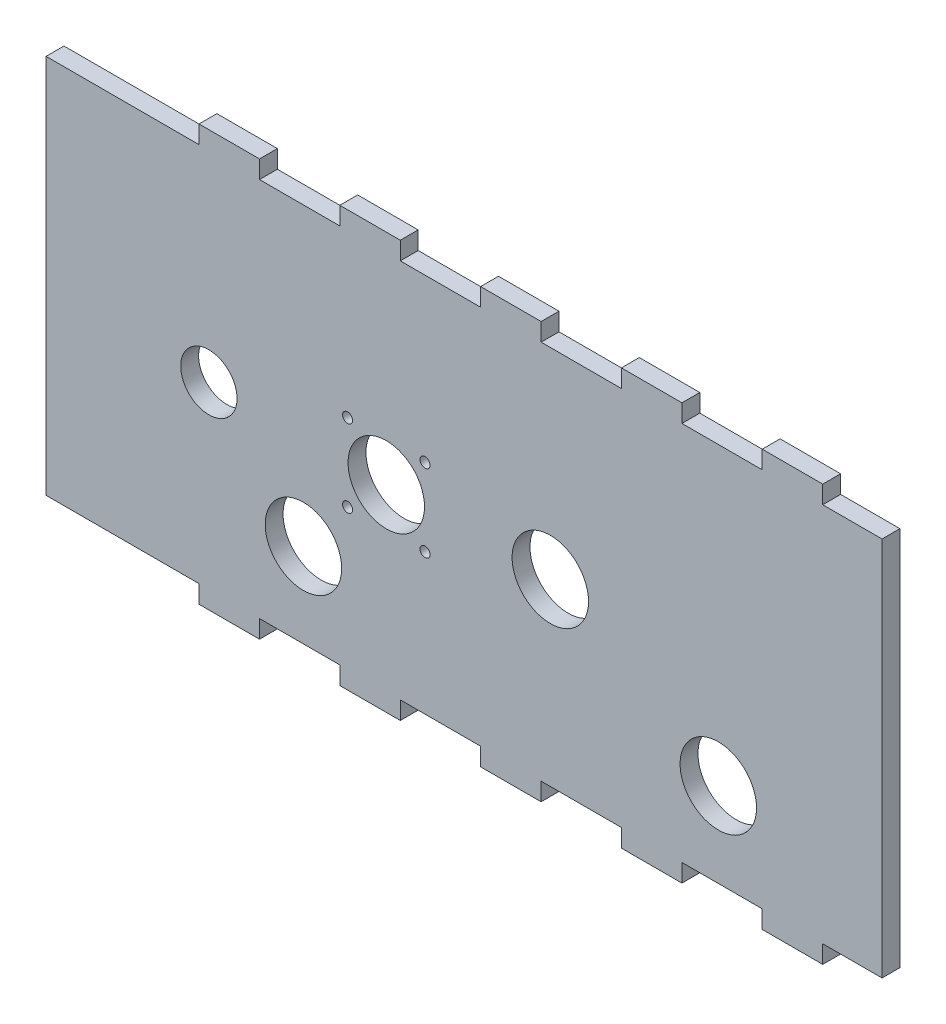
from build123d import *

# Parameters (mm, degrees)
SKETCH1_R           = 13.575
SKETCH1_R_2         = 1.778
SKETCH1_R_3         = 10
BOSS_EXTRUDE1_DEPTH = 6.35


with BuildPart() as part:
    # Sketch1 → Boss-Extrude1 (new body)
    with BuildSketch(Plane.XY):
        Polygon((154.3, 0), (154.3, -6.35), (175.785, -6.35), (175.785, 0), (204.3, 0), (204.3, -6.35), (225.785, -6.35), (225.785, 0), (254.3, 0), (254.3, -6.35), (275.785, -6.35), (275.785, 0), (296.845, 0), (296.845, 135), (275.785, 135), (275.785, 141.35), (254.3, 141.35), (254.3, 135), (225.785, 135), (225.785, 141.35), (204.3, 141.35), (204.3, 135), (175.785, 135), (175.785, 141.35), (154.3, 141.35), (154.3, 135), (125.785, 135), (125.785, 141.35), (104.3, 141.35), (104.3, 135), (75.785, 135), (75.785, 141.35), (54.3, 141.35), (54.3, 135), (0, 135), (0, 0), (54.3, 0), (54.3, -6.35), (75.785, -6.35), (75.785, 0), (104.3, 0), (104.3, -6.35), (125.785, -6.35), (125.785, 0), align=None)
        with Locations((91.3825, 30)):
            Circle(SKETCH1_R, mode=Mode.SUBTRACT)
        with Locations((238.7025, 30)):
            Circle(SKETCH1_R, mode=Mode.SUBTRACT)
        with Locations((179.048874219, 63.670386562)):
            Circle(SKETCH1_R, mode=Mode.SUBTRACT)
        with Locations((120.808874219, 63.670386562)):
            Circle(SKETCH1_R, mode=Mode.SUBTRACT)
        with Locations((107.060102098, 77.419158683)):
            Circle(SKETCH1_R_2, mode=Mode.SUBTRACT)
        with Locations((107.060102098, 49.921614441)):
            Circle(SKETCH1_R_2, mode=Mode.SUBTRACT)
        with Locations((134.557646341, 77.419158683)):
            Circle(SKETCH1_R_2, mode=Mode.SUBTRACT)
        with Locations((134.557646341, 49.921614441)):
            Circle(SKETCH1_R_2, mode=Mode.SUBTRACT)
        with Locations((57.808874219, 63.670386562)):
            Circle(SKETCH1_R_3, mode=Mode.SUBTRACT)
    extrude(amount=BOSS_EXTRUDE1_DEPTH)


solid = part.part
